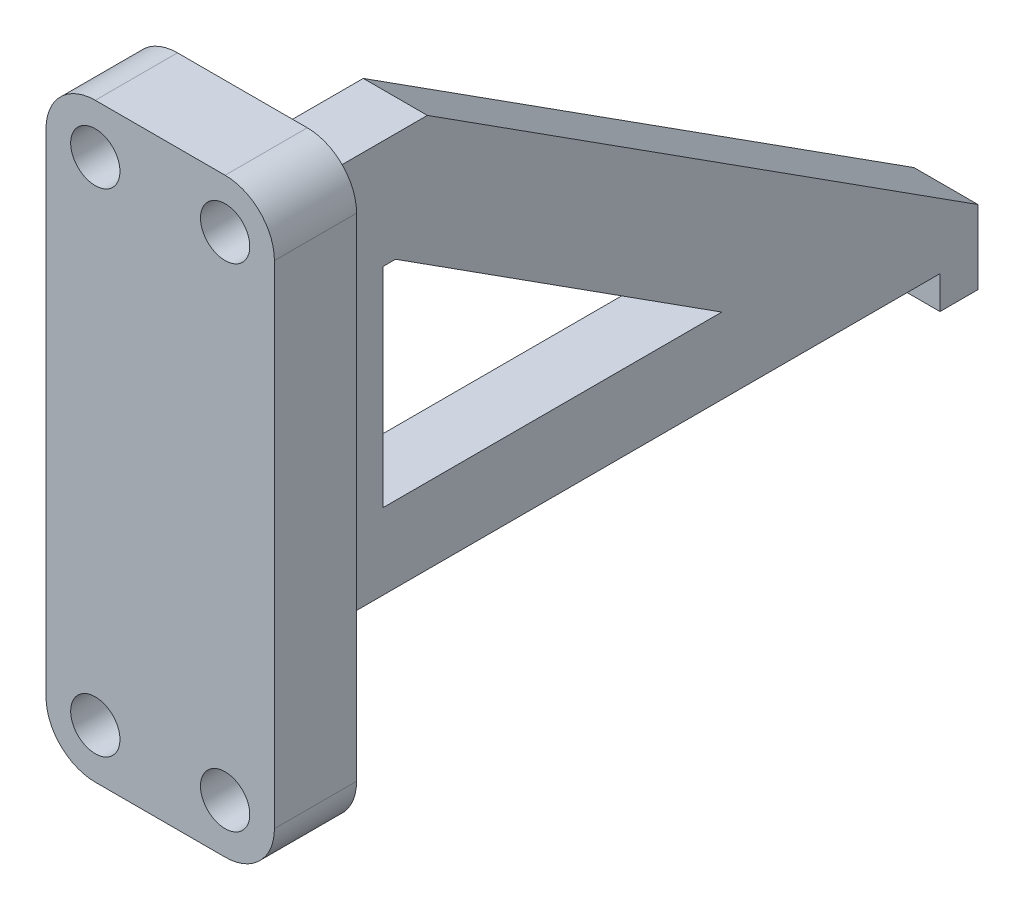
from build123d import *

# Parameters (mm, degrees)
EXTRUIR1_DEPTH = 7.797851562
CROQUIS2_W     = 27.797851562
CROQUIS2_H     = 71.872077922
EXTRUIR2_DEPTH = 10
CROQUIS3_R     = 3
EXTRUIR3_DEPTH = 10
REDONDEO3_R    = 6
EXTRUIR4_DEPTH = 10
CROQUIS6_W     = 77
CROQUIS6_H     = 17.28673747
EXTRUIR5_DEPTH = 10


with BuildPart() as part:
    # Croquis1 → Extruir1 (new body)
    with BuildSketch(Plane(origin=(0, 0, 0), x_dir=(0, 0, -1), z_dir=(1, 0, 0))):
        Polygon((0, 51.872077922), (0, 0), (85.624941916, 0), (85.624941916, 8.972467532), (18.611825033, 51.872077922), align=None)
    extrude(amount=EXTRUIR1_DEPTH)

    # Croquis2 → Extruir2 (add)
    with BuildSketch(Plane.XY):
        with Locations((3.898925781, 25.936038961)):
            Rectangle(CROQUIS2_W, CROQUIS2_H)
    extrude(amount=EXTRUIR2_DEPTH)

    # Croquis3 → Extruir3 (cut)
    with BuildSketch(Plane(origin=(0, 0, 0), x_dir=(-1, 0, 0), z_dir=(0, 0, -1))):
        with Locations((-11.797851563, 55.872077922)):
            Circle(CROQUIS3_R)
        with Locations((4, 55.872077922)):
            Circle(CROQUIS3_R)
        with Locations((-11.797851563, -4)):
            Circle(CROQUIS3_R)
        with Locations((4, -4)):
            Circle(CROQUIS3_R)
    extrude(amount=-EXTRUIR3_DEPTH, mode=Mode.SUBTRACT)

    # Redondeo3
    redondeo3_edges = [part.edges().sort_by_distance(p)[0] for p in [
        (17.797851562, 61.872077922, 5),
        (-10, 61.872077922, 5),
        (-10, -10, 5),
        (17.797851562, -10, 5),
    ]]
    fillet(redondeo3_edges, radius=REDONDEO3_R)

    # Croquis5 → Extruir4 (cut)
    with BuildSketch(Plane.ZY):
        Polygon((-14.740397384, 38.643989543), (-54.442360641, 13.228088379), (-13.228088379, 13.228088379), (-13.228088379, 38.643989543), align=None)
    extrude(amount=-EXTRUIR4_DEPTH, mode=Mode.SUBTRACT)

    # Croquis6 → Extruir5 (cut)
    with BuildSketch(Plane.ZY):
        with Locations((-42.5, -4.643368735)):
            Rectangle(CROQUIS6_W, CROQUIS6_H)
    extrude(amount=-EXTRUIR5_DEPTH, mode=Mode.SUBTRACT)


solid = part.part
